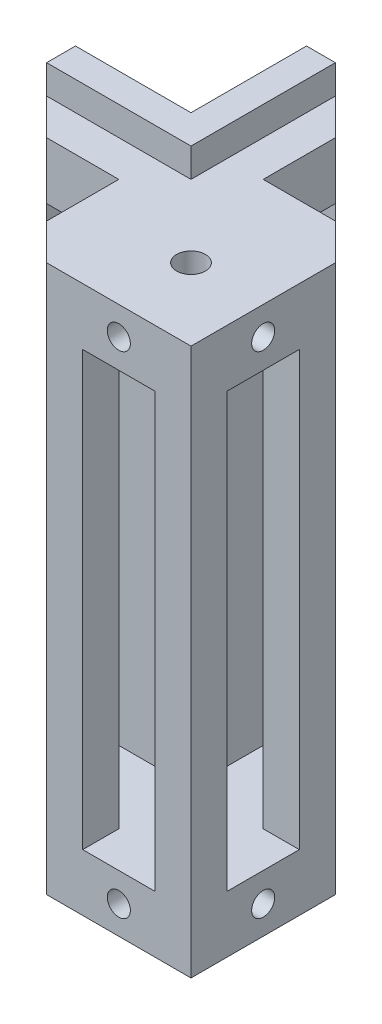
from build123d import *

# Parameters (mm, degrees)
SKETCH1_R                = 1
SKETCH1_W                = 5
SKETCH1_H                = 5
BOSS_EXTRUDE1_DEPTH      = 37.9
SKETCH2_R                = 0.8
BOSS_EXTRUDE2_DEPTH      = 3
SKETCH3_R                = 0.8
BOSS_EXTRUDE3_DEPTH      = 3
BOSS_EXTRUDE4_DEPTH      = 2
BOSS_EXTRUDE4_DEPTH_BACK = 39.9
SKETCH5_W                = 5
SKETCH5_H                = 30
CUT_EXTRUDE1_DEPTH       = 49.908179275
SKETCH6_W                = 5
SKETCH6_H                = 30
CUT_EXTRUDE2_DEPTH       = 49.908179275
SKETCH7_W                = 5
SKETCH7_H                = 30
CUT_EXTRUDE3_DEPTH       = 49.908179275
SKETCH8_W                = 5
SKETCH8_H                = 30
CUT_EXTRUDE4_DEPTH       = 49.908179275
SKETCH9_R                = 0.8
CUT_EXTRUDE6_DEPTH       = 3
CUT_EXTRUDE7_DEPTH       = 49.908179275
SKETCH12_R               = 0.8
CUT_EXTRUDE8_DEPTH       = 3


with BuildPart() as part:
    # Sketch1 → Boss-Extrude1 (new body)
    with BuildSketch(Plane(origin=(0, 0, 0), x_dir=(1, 0, 0), z_dir=(0, 1, 0))):
        Polygon((0, 0), (20, 0), (20, 20), (10, 20), (10, 10), (0, 10), align=None)
        with Locations(Location((15, 5, 0), (0, 0, 270))):
            Circle(SKETCH1_R, mode=Mode.SUBTRACT)
        with Locations((5, 5)):
            Rectangle(SKETCH1_W, SKETCH1_H, mode=Mode.SUBTRACT)
        with Locations((15, 15)):
            Rectangle(SKETCH1_W, SKETCH1_H, mode=Mode.SUBTRACT)
    extrude(amount=-BOSS_EXTRUDE1_DEPTH)

    # Sketch2 → Boss-Extrude2 (add)
    with BuildSketch(Plane.XY):
        with Locations((15, -1.95)):
            Circle(SKETCH2_R)
        with Locations((15, -5.95)):
            Circle(SKETCH2_R)
        with Locations((15, -31.95)):
            Circle(SKETCH2_R)
        with Locations((15, -35.95)):
            Circle(SKETCH2_R)
    extrude(amount=-BOSS_EXTRUDE2_DEPTH)

    # Sketch3 → Boss-Extrude3 (add)
    with BuildSketch(Plane(origin=(20, 0, 0), x_dir=(0, 0, -1), z_dir=(1, 0, 0))):
        with Locations((5, -1.95)):
            Circle(SKETCH3_R)
        with Locations((5, -5.95)):
            Circle(SKETCH3_R)
        with Locations((5, -31.95)):
            Circle(SKETCH3_R)
        with Locations((5, -35.95)):
            Circle(SKETCH3_R)
    extrude(amount=-BOSS_EXTRUDE3_DEPTH)

    # Sketch4 → Boss-Extrude4 (add, two sides: drawn at the far end of the back side and taken through both)
    with BuildSketch(Plane(origin=(0, 0, 0), x_dir=(1, 0, 0), z_dir=(0, 1, 0)).offset(-BOSS_EXTRUDE4_DEPTH_BACK)):
        Polygon((0, 10), (0, 12), (8, 12), (8, 20), (10, 20), (10, 10), align=None)
    extrude(amount=BOSS_EXTRUDE4_DEPTH + BOSS_EXTRUDE4_DEPTH_BACK)

    # Sketch5 → Cut-Extrude1 (cut, through all)
    with BuildSketch(Plane.XY):
        with Locations((5, -18.95)):
            Rectangle(SKETCH5_W, SKETCH5_H)
    extrude(amount=-CUT_EXTRUDE1_DEPTH, mode=Mode.SUBTRACT)

    # Sketch6 → Cut-Extrude2 (cut, through all)
    with BuildSketch(Plane(origin=(20, 0, 0), x_dir=(0, 0, -1), z_dir=(1, 0, 0))):
        with Locations((15, -18.95)):
            Rectangle(SKETCH6_W, SKETCH6_H)
    extrude(amount=-CUT_EXTRUDE2_DEPTH, mode=Mode.SUBTRACT)

    # Sketch7 → Cut-Extrude3 (cut, through all)
    with BuildSketch(Plane(origin=(0, 0, -20), x_dir=(-1, 0, 0), z_dir=(0, 0, -1))):
        with Locations((-15, -18.95)):
            Rectangle(SKETCH7_W, SKETCH7_H)
    extrude(amount=-CUT_EXTRUDE3_DEPTH, mode=Mode.SUBTRACT)

    # Sketch8 → Cut-Extrude4 (cut, through all)
    with BuildSketch(Plane.ZY):
        with Locations((-5, -18.95)):
            Rectangle(SKETCH8_W, SKETCH8_H)
    extrude(amount=-CUT_EXTRUDE4_DEPTH, mode=Mode.SUBTRACT)

    # Sketch9 → Cut-Extrude6 (cut)
    with BuildSketch(Plane.XY):
        with Locations((15, -1.95)):
            Circle(SKETCH9_R)
        with Locations((15, -35.95)):
            Circle(SKETCH9_R)
    extrude(amount=-CUT_EXTRUDE6_DEPTH, mode=Mode.SUBTRACT)

    # Sketch11 → Cut-Extrude7 (cut, through all)
    with BuildSketch(Plane(origin=(0, 0, 0), x_dir=(1, 0, 0), z_dir=(0, 1, 0))):
        Polygon((0, 10), (10, 0), (0, 0), align=None)
        Polygon((20, 10), (20, 20), (10, 20), align=None)
    extrude(amount=-CUT_EXTRUDE7_DEPTH, mode=Mode.SUBTRACT)

    # Sketch12 → Cut-Extrude8 (cut)
    with BuildSketch(Plane(origin=(20, 0, 0), x_dir=(0, 0, -1), z_dir=(1, 0, 0))):
        with Locations((5, -1.95)):
            Circle(SKETCH12_R)
        with Locations((5, -35.95)):
            Circle(SKETCH12_R)
    extrude(amount=-CUT_EXTRUDE8_DEPTH, mode=Mode.SUBTRACT)


solid = part.part
